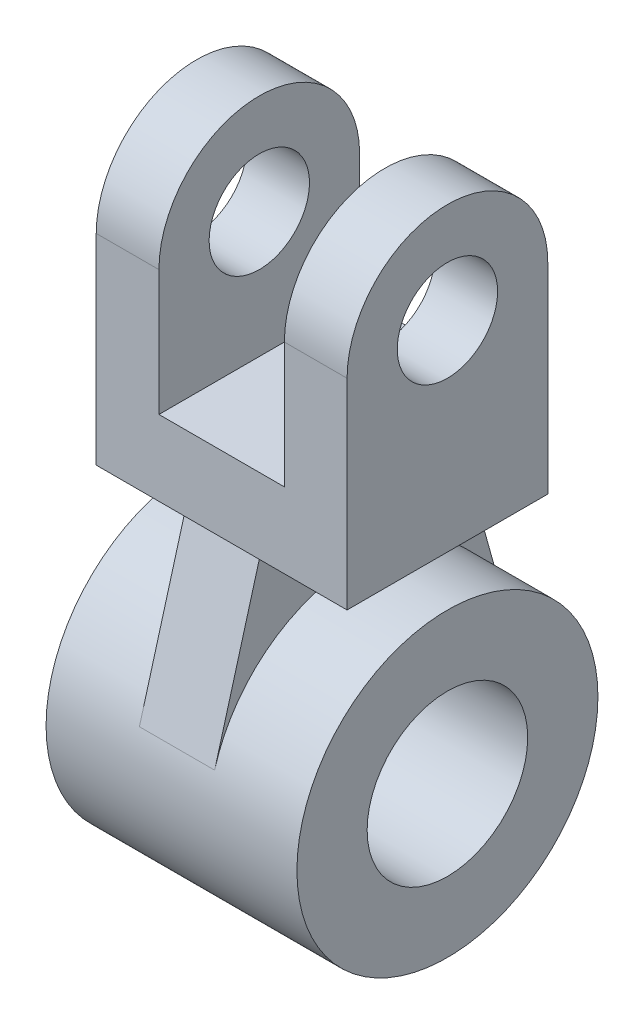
ISO-10303-21;
HEADER;
FILE_DESCRIPTION(('STEP AP214'),'2;1');
FILE_NAME('part.step','',(''),(''),'','','');
FILE_SCHEMA(('AUTOMOTIVE_DESIGN { 1 0 10303 214 1 1 1 1 }'));
ENDSEC;
DATA;
#1=APPLICATION_CONTEXT('core data for automotive mechanical design processes');
#2=APPLICATION_PROTOCOL_DEFINITION('international standard','automotive_design',2000,#1);
#3=PRODUCT_CONTEXT('',#1,'mechanical');
#4=PRODUCT('Part','Part','',(#3));
#5=PRODUCT_RELATED_PRODUCT_CATEGORY('part','',(#4));
#6=PRODUCT_DEFINITION_FORMATION('','',#4);
#7=PRODUCT_DEFINITION_CONTEXT('part definition',#1,'design');
#8=PRODUCT_DEFINITION('design','',#6,#7);
#9=PRODUCT_DEFINITION_SHAPE('','',#8);
#10=(LENGTH_UNIT() NAMED_UNIT(*) SI_UNIT(.MILLI.,.METRE.));
#11=(NAMED_UNIT(*) PLANE_ANGLE_UNIT() SI_UNIT($,.RADIAN.));
#12=(NAMED_UNIT(*) SI_UNIT($,.STERADIAN.) SOLID_ANGLE_UNIT());
#13=UNCERTAINTY_MEASURE_WITH_UNIT(LENGTH_MEASURE(1.E-05),#10,'distance_accuracy_value','');
#14=(GEOMETRIC_REPRESENTATION_CONTEXT(3) GLOBAL_UNCERTAINTY_ASSIGNED_CONTEXT((#13)) GLOBAL_UNIT_ASSIGNED_CONTEXT((#10,
#11,#12)) REPRESENTATION_CONTEXT('',''));
#15=CARTESIAN_POINT('',(0.,0.,0.));
#16=DIRECTION('',(0.,0.,1.));
#17=DIRECTION('',(1.,0.,0.));
#18=AXIS2_PLACEMENT_3D('',#15,#16,#17);
#19=CARTESIAN_POINT('',(-50.,0.,0.));
#20=DIRECTION('',(1.,0.,0.));
#21=DIRECTION('',(0.,0.,-1.));
#22=AXIS2_PLACEMENT_3D('',#19,#20,#21);
#23=CYLINDRICAL_SURFACE('',#22,30.);
#24=CARTESIAN_POINT('',(-32.5,0.,0.));
#25=DIRECTION('',(1.,0.,0.));
#26=DIRECTION('',(0.,0.,1.));
#27=AXIS2_PLACEMENT_3D('',#24,#25,#26);
#28=CIRCLE('',#27,30.);
#29=CARTESIAN_POINT('',(-32.5,8.05012538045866,-28.899748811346));
#30=VERTEX_POINT('',#29);
#31=CARTESIAN_POINT('',(-32.5,8.0501256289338,28.8997487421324));
#32=VERTEX_POINT('',#31);
#33=EDGE_CURVE('E64',#30,#32,#28,.T.);
#34=ORIENTED_EDGE('',*,*,#33,.F.);
#35=DIRECTION('',(1.,0.,0.));
#36=VECTOR('',#35,1.);
#37=CARTESIAN_POINT('',(-32.5,8.05012538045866,-28.899748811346));
#38=LINE('',#37,#36);
#39=CARTESIAN_POINT('',(-17.5,8.05012538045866,-28.899748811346));
#40=VERTEX_POINT('',#39);
#41=EDGE_CURVE('E276',#30,#40,#38,.T.);
#42=ORIENTED_EDGE('',*,*,#41,.T.);
#43=CARTESIAN_POINT('',(-17.5,0.,0.));
#44=DIRECTION('',(1.,0.,0.));
#45=DIRECTION('',(0.,0.,1.));
#46=AXIS2_PLACEMENT_3D('',#43,#44,#45);
#47=CIRCLE('',#46,30.);
#48=CARTESIAN_POINT('',(-17.5,8.0501256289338,28.8997487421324));
#49=VERTEX_POINT('',#48);
#50=EDGE_CURVE('E263',#40,#49,#47,.T.);
#51=ORIENTED_EDGE('',*,*,#50,.T.);
#52=DIRECTION('',(1.,0.,0.));
#53=VECTOR('',#52,1.);
#54=CARTESIAN_POINT('',(-32.5,8.0501256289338,28.8997487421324));
#55=LINE('',#54,#53);
#56=EDGE_CURVE('E256',#32,#49,#55,.T.);
#57=ORIENTED_EDGE('',*,*,#56,.F.);
#58=EDGE_LOOP('',(#34,#42,#51,#57));
#59=FACE_BOUND('',#58,.T.);
#60=CARTESIAN_POINT('',(-50.,0.,0.));
#61=DIRECTION('',(1.,0.,0.));
#62=DIRECTION('',(0.,0.,-1.));
#63=AXIS2_PLACEMENT_3D('',#60,#61,#62);
#64=CIRCLE('',#63,30.);
#65=CARTESIAN_POINT('',(-50.,0.,-30.));
#66=VERTEX_POINT('',#65);
#67=EDGE_CURVE('E11',#66,#66,#64,.T.);
#68=ORIENTED_EDGE('',*,*,#67,.T.);
#69=EDGE_LOOP('',(#68));
#70=FACE_BOUND('',#69,.T.);
#71=CARTESIAN_POINT('',(0.,0.,0.));
#72=DIRECTION('',(1.,0.,0.));
#73=DIRECTION('',(0.,0.,-1.));
#74=AXIS2_PLACEMENT_3D('',#71,#72,#73);
#75=CIRCLE('',#74,30.);
#76=CARTESIAN_POINT('',(0.,0.,-30.));
#77=VERTEX_POINT('',#76);
#78=EDGE_CURVE('E47',#77,#77,#75,.T.);
#79=ORIENTED_EDGE('',*,*,#78,.F.);
#80=EDGE_LOOP('',(#79));
#81=FACE_BOUND('',#80,.T.);
#82=ADVANCED_FACE('F39',(#59,#70,#81),#23,.T.);
#83=CARTESIAN_POINT('',(-50.,0.,0.));
#84=DIRECTION('',(1.,0.,0.));
#85=DIRECTION('',(0.,0.,-1.));
#86=AXIS2_PLACEMENT_3D('',#83,#84,#85);
#87=PLANE('',#86);
#88=CARTESIAN_POINT('',(-50.,0.,0.));
#89=DIRECTION('',(1.,0.,0.));
#90=DIRECTION('',(0.,0.,-1.));
#91=AXIS2_PLACEMENT_3D('',#88,#89,#90);
#92=CIRCLE('',#91,16.);
#93=CARTESIAN_POINT('',(-50.,0.,-16.));
#94=VERTEX_POINT('',#93);
#95=EDGE_CURVE('E280',#94,#94,#92,.T.);
#96=ORIENTED_EDGE('',*,*,#95,.T.);
#97=EDGE_LOOP('',(#96));
#98=FACE_BOUND('',#97,.T.);
#99=ORIENTED_EDGE('',*,*,#67,.F.);
#100=EDGE_LOOP('',(#99));
#101=FACE_BOUND('',#100,.T.);
#102=ADVANCED_FACE('F340',(#98,#101),#87,.F.);
#103=CARTESIAN_POINT('',(0.,0.,0.));
#104=DIRECTION('',(1.,0.,0.));
#105=DIRECTION('',(0.,0.,-1.));
#106=AXIS2_PLACEMENT_3D('',#103,#104,#105);
#107=PLANE('',#106);
#108=CARTESIAN_POINT('',(0.,0.,0.));
#109=DIRECTION('',(1.,0.,0.));
#110=DIRECTION('',(0.,0.,-1.));
#111=AXIS2_PLACEMENT_3D('',#108,#109,#110);
#112=CIRCLE('',#111,16.);
#113=CARTESIAN_POINT('',(0.,0.,-16.));
#114=VERTEX_POINT('',#113);
#115=EDGE_CURVE('E283',#114,#114,#112,.T.);
#116=ORIENTED_EDGE('',*,*,#115,.F.);
#117=EDGE_LOOP('',(#116));
#118=FACE_BOUND('',#117,.T.);
#119=ORIENTED_EDGE('',*,*,#78,.T.);
#120=EDGE_LOOP('',(#119));
#121=FACE_BOUND('',#120,.T.);
#122=ADVANCED_FACE('F344',(#118,#121),#107,.T.);
#123=CARTESIAN_POINT('',(-50.,0.,0.));
#124=DIRECTION('',(1.,0.,0.));
#125=DIRECTION('',(0.,0.,-1.));
#126=AXIS2_PLACEMENT_3D('',#123,#124,#125);
#127=CYLINDRICAL_SURFACE('',#126,16.);
#128=ORIENTED_EDGE('',*,*,#95,.F.);
#129=EDGE_LOOP('',(#128));
#130=FACE_BOUND('',#129,.T.);
#131=ORIENTED_EDGE('',*,*,#115,.T.);
#132=EDGE_LOOP('',(#131));
#133=FACE_BOUND('',#132,.T.);
#134=ADVANCED_FACE('F350',(#130,#133),#127,.F.);
#135=CARTESIAN_POINT('',(-32.5,40.,-20.));
#136=DIRECTION('',(0.,-0.26833752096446,0.96332495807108));
#137=DIRECTION('',(0.,-0.96332495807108,-0.26833752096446));
#138=AXIS2_PLACEMENT_3D('',#135,#136,#137);
#139=PLANE('',#138);
#140=DIRECTION('',(0.,-0.96332495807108,-0.26833752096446));
#141=VECTOR('',#140,1.);
#142=CARTESIAN_POINT('',(-17.5,40.,-20.));
#143=LINE('',#142,#141);
#144=CARTESIAN_POINT('',(-17.5,40.,-20.));
#145=VERTEX_POINT('',#144);
#146=EDGE_CURVE('E76',#145,#40,#143,.T.);
#147=ORIENTED_EDGE('',*,*,#146,.T.);
#148=ORIENTED_EDGE('',*,*,#41,.F.);
#149=DIRECTION('',(0.,-0.96332495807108,-0.26833752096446));
#150=VECTOR('',#149,1.);
#151=CARTESIAN_POINT('',(-32.5,40.,-20.));
#152=LINE('',#151,#150);
#153=CARTESIAN_POINT('',(-32.5,40.,-20.));
#154=VERTEX_POINT('',#153);
#155=EDGE_CURVE('E288',#154,#30,#152,.T.);
#156=ORIENTED_EDGE('',*,*,#155,.F.);
#157=DIRECTION('',(1.,0.,0.));
#158=VECTOR('',#157,1.);
#159=CARTESIAN_POINT('',(-32.5,40.,-20.));
#160=LINE('',#159,#158);
#161=EDGE_CURVE('E279',#154,#145,#160,.T.);
#162=ORIENTED_EDGE('',*,*,#161,.T.);
#163=EDGE_LOOP('',(#147,#148,#156,#162));
#164=FACE_BOUND('',#163,.T.);
#165=ADVANCED_FACE('F306',(#164),#139,.F.);
#166=CARTESIAN_POINT('',(-32.5,40.,20.));
#167=DIRECTION('',(0.,-0.26833752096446,-0.96332495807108));
#168=DIRECTION('',(0.,0.96332495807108,-0.26833752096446));
#169=AXIS2_PLACEMENT_3D('',#166,#167,#168);
#170=PLANE('',#169);
#171=DIRECTION('',(0.,0.96332495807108,-0.26833752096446));
#172=VECTOR('',#171,1.);
#173=CARTESIAN_POINT('',(-17.5,40.,20.));
#174=LINE('',#173,#172);
#175=CARTESIAN_POINT('',(-17.5,40.,20.));
#176=VERTEX_POINT('',#175);
#177=EDGE_CURVE('E55',#49,#176,#174,.T.);
#178=ORIENTED_EDGE('',*,*,#177,.T.);
#179=DIRECTION('',(1.,0.,0.));
#180=VECTOR('',#179,1.);
#181=CARTESIAN_POINT('',(-32.5,40.,20.));
#182=LINE('',#181,#180);
#183=CARTESIAN_POINT('',(-32.5,40.,20.));
#184=VERTEX_POINT('',#183);
#185=EDGE_CURVE('E253',#184,#176,#182,.T.);
#186=ORIENTED_EDGE('',*,*,#185,.F.);
#187=DIRECTION('',(0.,0.96332495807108,-0.26833752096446));
#188=VECTOR('',#187,1.);
#189=CARTESIAN_POINT('',(-32.5,40.,20.));
#190=LINE('',#189,#188);
#191=EDGE_CURVE('E257',#32,#184,#190,.T.);
#192=ORIENTED_EDGE('',*,*,#191,.F.);
#193=ORIENTED_EDGE('',*,*,#56,.T.);
#194=EDGE_LOOP('',(#178,#186,#192,#193));
#195=FACE_BOUND('',#194,.T.);
#196=ADVANCED_FACE('F259',(#195),#170,.F.);
#197=CARTESIAN_POINT('',(-32.5,0.,0.));
#198=DIRECTION('',(-1.,0.,0.));
#199=DIRECTION('',(0.,0.,1.));
#200=AXIS2_PLACEMENT_3D('',#197,#198,#199);
#201=PLANE('',#200);
#202=DIRECTION('',(0.,0.,-1.));
#203=VECTOR('',#202,1.);
#204=CARTESIAN_POINT('',(-32.5,40.,-20.));
#205=LINE('',#204,#203);
#206=EDGE_CURVE('E262',#184,#154,#205,.T.);
#207=ORIENTED_EDGE('',*,*,#206,.T.);
#208=ORIENTED_EDGE('',*,*,#155,.T.);
#209=ORIENTED_EDGE('',*,*,#33,.T.);
#210=ORIENTED_EDGE('',*,*,#191,.T.);
#211=EDGE_LOOP('',(#207,#208,#209,#210));
#212=FACE_BOUND('',#211,.T.);
#213=ADVANCED_FACE('F302',(#212),#201,.T.);
#214=CARTESIAN_POINT('',(-17.5,0.,0.));
#215=DIRECTION('',(-1.,0.,0.));
#216=DIRECTION('',(0.,0.,1.));
#217=AXIS2_PLACEMENT_3D('',#214,#215,#216);
#218=PLANE('',#217);
#219=DIRECTION('',(0.,0.,-1.));
#220=VECTOR('',#219,1.);
#221=CARTESIAN_POINT('',(-17.5,40.,-20.));
#222=LINE('',#221,#220);
#223=EDGE_CURVE('E84',#176,#145,#222,.T.);
#224=ORIENTED_EDGE('',*,*,#223,.F.);
#225=ORIENTED_EDGE('',*,*,#177,.F.);
#226=ORIENTED_EDGE('',*,*,#50,.F.);
#227=ORIENTED_EDGE('',*,*,#146,.F.);
#228=EDGE_LOOP('',(#224,#225,#226,#227));
#229=FACE_BOUND('',#228,.T.);
#230=ADVANCED_FACE('F265',(#229),#218,.F.);
#231=CARTESIAN_POINT('',(-12.5,40.,0.));
#232=DIRECTION('',(0.,-1.,0.));
#233=DIRECTION('',(0.,0.,-1.));
#234=AXIS2_PLACEMENT_3D('',#231,#232,#233);
#235=PLANE('',#234);
#236=ORIENTED_EDGE('',*,*,#206,.F.);
#237=DIRECTION('',(1.,0.,0.));
#238=VECTOR('',#237,1.);
#239=CARTESIAN_POINT('',(-12.5,40.,20.));
#240=LINE('',#239,#238);
#241=CARTESIAN_POINT('',(-50.,40.,20.));
#242=VERTEX_POINT('',#241);
#243=EDGE_CURVE('E192',#242,#184,#240,.T.);
#244=ORIENTED_EDGE('',*,*,#243,.F.);
#245=DIRECTION('',(0.,0.,1.));
#246=VECTOR('',#245,1.);
#247=CARTESIAN_POINT('',(-50.,40.,-20.));
#248=LINE('',#247,#246);
#249=CARTESIAN_POINT('',(-50.,40.,-20.));
#250=VERTEX_POINT('',#249);
#251=EDGE_CURVE('E169',#250,#242,#248,.T.);
#252=ORIENTED_EDGE('',*,*,#251,.F.);
#253=DIRECTION('',(1.,0.,0.));
#254=VECTOR('',#253,1.);
#255=CARTESIAN_POINT('',(-12.5,40.,-20.));
#256=LINE('',#255,#254);
#257=EDGE_CURVE('E242',#250,#154,#256,.T.);
#258=ORIENTED_EDGE('',*,*,#257,.T.);
#259=EDGE_LOOP('',(#236,#244,#252,#258));
#260=FACE_BOUND('',#259,.T.);
#261=ADVANCED_FACE('F310',(#260),#235,.T.);
#262=CARTESIAN_POINT('',(-12.5,0.,-20.));
#263=DIRECTION('',(0.,0.,1.));
#264=DIRECTION('',(1.,0.,0.));
#265=AXIS2_PLACEMENT_3D('',#262,#263,#264);
#266=PLANE('',#265);
#267=DIRECTION('',(0.,-1.,0.));
#268=VECTOR('',#267,1.);
#269=CARTESIAN_POINT('',(0.,0.,-20.));
#270=LINE('',#269,#268);
#271=CARTESIAN_POINT('',(0.,80.,-20.));
#272=VERTEX_POINT('',#271);
#273=CARTESIAN_POINT('',(0.,40.,-20.));
#274=VERTEX_POINT('',#273);
#275=EDGE_CURVE('E224',#272,#274,#270,.T.);
#276=ORIENTED_EDGE('',*,*,#275,.T.);
#277=EDGE_CURVE('E196',#145,#274,#256,.T.);
#278=ORIENTED_EDGE('',*,*,#277,.F.);
#279=ORIENTED_EDGE('',*,*,#161,.F.);
#280=ORIENTED_EDGE('',*,*,#257,.F.);
#281=DIRECTION('',(0.,-1.,0.));
#282=VECTOR('',#281,1.);
#283=CARTESIAN_POINT('',(-50.,80.,-20.));
#284=LINE('',#283,#282);
#285=CARTESIAN_POINT('',(-50.,80.,-20.));
#286=VERTEX_POINT('',#285);
#287=EDGE_CURVE('E148',#286,#250,#284,.T.);
#288=ORIENTED_EDGE('',*,*,#287,.F.);
#289=DIRECTION('',(-1.,0.,0.));
#290=VECTOR('',#289,1.);
#291=CARTESIAN_POINT('',(-37.5,80.,-20.));
#292=LINE('',#291,#290);
#293=CARTESIAN_POINT('',(-37.5,80.,-20.));
#294=VERTEX_POINT('',#293);
#295=EDGE_CURVE('E140',#294,#286,#292,.T.);
#296=ORIENTED_EDGE('',*,*,#295,.F.);
#297=DIRECTION('',(0.,-1.,0.));
#298=VECTOR('',#297,1.);
#299=CARTESIAN_POINT('',(-37.5,80.,-20.));
#300=LINE('',#299,#298);
#301=CARTESIAN_POINT('',(-37.5,55.,-20.));
#302=VERTEX_POINT('',#301);
#303=EDGE_CURVE('E145',#294,#302,#300,.T.);
#304=ORIENTED_EDGE('',*,*,#303,.T.);
#305=DIRECTION('',(-1.,0.,0.));
#306=VECTOR('',#305,1.);
#307=CARTESIAN_POINT('',(-37.5,55.,-20.));
#308=LINE('',#307,#306);
#309=CARTESIAN_POINT('',(-12.5,55.,-20.));
#310=VERTEX_POINT('',#309);
#311=EDGE_CURVE('E320',#310,#302,#308,.T.);
#312=ORIENTED_EDGE('',*,*,#311,.F.);
#313=DIRECTION('',(0.,-1.,0.));
#314=VECTOR('',#313,1.);
#315=CARTESIAN_POINT('',(-12.5,0.,-20.));
#316=LINE('',#315,#314);
#317=CARTESIAN_POINT('',(-12.5,80.,-20.));
#318=VERTEX_POINT('',#317);
#319=EDGE_CURVE('E210',#318,#310,#316,.T.);
#320=ORIENTED_EDGE('',*,*,#319,.F.);
#321=DIRECTION('',(1.,0.,0.));
#322=VECTOR('',#321,1.);
#323=CARTESIAN_POINT('',(-12.5,80.,-20.));
#324=LINE('',#323,#322);
#325=EDGE_CURVE('E207',#318,#272,#324,.T.);
#326=ORIENTED_EDGE('',*,*,#325,.T.);
#327=EDGE_LOOP('',(#276,#278,#279,#280,#288,#296,#304,#312,#320,#326));
#328=FACE_BOUND('',#327,.T.);
#329=ADVANCED_FACE('F143',(#328),#266,.F.);
#330=CARTESIAN_POINT('',(0.,40.,20.));
#331=VERTEX_POINT('',#330);
#332=EDGE_CURVE('E197',#176,#331,#240,.T.);
#333=ORIENTED_EDGE('',*,*,#332,.F.);
#334=ORIENTED_EDGE('',*,*,#223,.T.);
#335=ORIENTED_EDGE('',*,*,#277,.T.);
#336=DIRECTION('',(0.,0.,-1.));
#337=VECTOR('',#336,1.);
#338=CARTESIAN_POINT('',(0.,40.,0.));
#339=LINE('',#338,#337);
#340=EDGE_CURVE('E215',#331,#274,#339,.T.);
#341=ORIENTED_EDGE('',*,*,#340,.F.);
#342=EDGE_LOOP('',(#333,#334,#335,#341));
#343=FACE_BOUND('',#342,.T.);
#344=ADVANCED_FACE('F239',(#343),#235,.T.);
#345=CARTESIAN_POINT('',(-12.5,0.,20.));
#346=DIRECTION('',(0.,0.,1.));
#347=DIRECTION('',(1.,0.,0.));
#348=AXIS2_PLACEMENT_3D('',#345,#346,#347);
#349=PLANE('',#348);
#350=DIRECTION('',(0.,-1.,0.));
#351=VECTOR('',#350,1.);
#352=CARTESIAN_POINT('',(0.,0.,20.));
#353=LINE('',#352,#351);
#354=CARTESIAN_POINT('',(0.,80.,20.));
#355=VERTEX_POINT('',#354);
#356=EDGE_CURVE('E230',#355,#331,#353,.T.);
#357=ORIENTED_EDGE('',*,*,#356,.F.);
#358=DIRECTION('',(1.,0.,0.));
#359=VECTOR('',#358,1.);
#360=CARTESIAN_POINT('',(-12.5,80.,20.));
#361=LINE('',#360,#359);
#362=CARTESIAN_POINT('',(-12.5,80.,20.));
#363=VERTEX_POINT('',#362);
#364=EDGE_CURVE('E204',#363,#355,#361,.T.);
#365=ORIENTED_EDGE('',*,*,#364,.F.);
#366=DIRECTION('',(0.,-1.,0.));
#367=VECTOR('',#366,1.);
#368=CARTESIAN_POINT('',(-12.5,0.,20.));
#369=LINE('',#368,#367);
#370=CARTESIAN_POINT('',(-12.5,55.,20.));
#371=VERTEX_POINT('',#370);
#372=EDGE_CURVE('E209',#363,#371,#369,.T.);
#373=ORIENTED_EDGE('',*,*,#372,.T.);
#374=DIRECTION('',(-1.,0.,0.));
#375=VECTOR('',#374,1.);
#376=CARTESIAN_POINT('',(-37.5,55.,20.));
#377=LINE('',#376,#375);
#378=CARTESIAN_POINT('',(-37.5,55.,20.));
#379=VERTEX_POINT('',#378);
#380=EDGE_CURVE('E318',#371,#379,#377,.T.);
#381=ORIENTED_EDGE('',*,*,#380,.T.);
#382=DIRECTION('',(0.,1.,0.));
#383=VECTOR('',#382,1.);
#384=CARTESIAN_POINT('',(-37.5,40.,20.));
#385=LINE('',#384,#383);
#386=CARTESIAN_POINT('',(-37.5,80.,20.));
#387=VERTEX_POINT('',#386);
#388=EDGE_CURVE('E154',#379,#387,#385,.T.);
#389=ORIENTED_EDGE('',*,*,#388,.T.);
#390=DIRECTION('',(-1.,0.,0.));
#391=VECTOR('',#390,1.);
#392=CARTESIAN_POINT('',(-37.5,80.,20.));
#393=LINE('',#392,#391);
#394=CARTESIAN_POINT('',(-50.,80.,20.));
#395=VERTEX_POINT('',#394);
#396=EDGE_CURVE('E153',#387,#395,#393,.T.);
#397=ORIENTED_EDGE('',*,*,#396,.T.);
#398=DIRECTION('',(0.,1.,0.));
#399=VECTOR('',#398,1.);
#400=CARTESIAN_POINT('',(-50.,40.,20.));
#401=LINE('',#400,#399);
#402=EDGE_CURVE('E166',#242,#395,#401,.T.);
#403=ORIENTED_EDGE('',*,*,#402,.F.);
#404=ORIENTED_EDGE('',*,*,#243,.T.);
#405=ORIENTED_EDGE('',*,*,#185,.T.);
#406=ORIENTED_EDGE('',*,*,#332,.T.);
#407=EDGE_LOOP('',(#357,#365,#373,#381,#389,#397,#403,#404,#405,#406));
#408=FACE_BOUND('',#407,.T.);
#409=ADVANCED_FACE('F251',(#408),#349,.T.);
#410=CARTESIAN_POINT('',(-12.5,80.,0.));
#411=DIRECTION('',(1.,0.,0.));
#412=DIRECTION('',(0.,0.,-1.));
#413=AXIS2_PLACEMENT_3D('',#410,#411,#412);
#414=CYLINDRICAL_SURFACE('',#413,20.);
#415=CARTESIAN_POINT('',(0.,80.,0.));
#416=DIRECTION('',(1.,0.,0.));
#417=DIRECTION('',(0.,0.,-1.));
#418=AXIS2_PLACEMENT_3D('',#415,#416,#417);
#419=CIRCLE('',#418,20.);
#420=EDGE_CURVE('E226',#272,#355,#419,.T.);
#421=ORIENTED_EDGE('',*,*,#420,.F.);
#422=ORIENTED_EDGE('',*,*,#325,.F.);
#423=CARTESIAN_POINT('',(-12.5,80.,0.));
#424=DIRECTION('',(1.,0.,0.));
#425=DIRECTION('',(0.,0.,-1.));
#426=AXIS2_PLACEMENT_3D('',#423,#424,#425);
#427=CIRCLE('',#426,20.);
#428=EDGE_CURVE('E214',#318,#363,#427,.T.);
#429=ORIENTED_EDGE('',*,*,#428,.T.);
#430=ORIENTED_EDGE('',*,*,#364,.T.);
#431=EDGE_LOOP('',(#421,#422,#429,#430));
#432=FACE_BOUND('',#431,.T.);
#433=ADVANCED_FACE('F247',(#432),#414,.T.);
#434=CARTESIAN_POINT('',(-12.5,0.,0.));
#435=DIRECTION('',(1.,0.,0.));
#436=DIRECTION('',(0.,0.,-1.));
#437=AXIS2_PLACEMENT_3D('',#434,#435,#436);
#438=PLANE('',#437);
#439=CARTESIAN_POINT('',(-12.5,80.,0.));
#440=DIRECTION('',(1.,0.,0.));
#441=DIRECTION('',(0.,0.,-1.));
#442=AXIS2_PLACEMENT_3D('',#439,#440,#441);
#443=CIRCLE('',#442,10.);
#444=CARTESIAN_POINT('',(-12.5,80.,-10.));
#445=VERTEX_POINT('',#444);
#446=EDGE_CURVE('E227',#445,#445,#443,.T.);
#447=ORIENTED_EDGE('',*,*,#446,.T.);
#448=EDGE_LOOP('',(#447));
#449=FACE_BOUND('',#448,.T.);
#450=ORIENTED_EDGE('',*,*,#319,.T.);
#451=DIRECTION('',(0.,0.,1.));
#452=VECTOR('',#451,1.);
#453=CARTESIAN_POINT('',(-12.5,55.,-20.));
#454=LINE('',#453,#452);
#455=EDGE_CURVE('E189',#310,#371,#454,.T.);
#456=ORIENTED_EDGE('',*,*,#455,.T.);
#457=ORIENTED_EDGE('',*,*,#372,.F.);
#458=ORIENTED_EDGE('',*,*,#428,.F.);
#459=EDGE_LOOP('',(#450,#456,#457,#458));
#460=FACE_BOUND('',#459,.T.);
#461=ADVANCED_FACE('F326',(#449,#460),#438,.F.);
#462=CARTESIAN_POINT('',(0.,0.,0.));
#463=DIRECTION('',(1.,0.,0.));
#464=DIRECTION('',(0.,0.,-1.));
#465=AXIS2_PLACEMENT_3D('',#462,#463,#464);
#466=PLANE('',#465);
#467=CARTESIAN_POINT('',(0.,80.,0.));
#468=DIRECTION('',(1.,0.,0.));
#469=DIRECTION('',(0.,0.,-1.));
#470=AXIS2_PLACEMENT_3D('',#467,#468,#469);
#471=CIRCLE('',#470,10.);
#472=CARTESIAN_POINT('',(0.,80.,-10.));
#473=VERTEX_POINT('',#472);
#474=EDGE_CURVE('E188',#473,#473,#471,.T.);
#475=ORIENTED_EDGE('',*,*,#474,.F.);
#476=EDGE_LOOP('',(#475));
#477=FACE_BOUND('',#476,.T.);
#478=ORIENTED_EDGE('',*,*,#275,.F.);
#479=ORIENTED_EDGE('',*,*,#420,.T.);
#480=ORIENTED_EDGE('',*,*,#356,.T.);
#481=ORIENTED_EDGE('',*,*,#340,.T.);
#482=EDGE_LOOP('',(#478,#479,#480,#481));
#483=FACE_BOUND('',#482,.T.);
#484=ADVANCED_FACE('F236',(#477,#483),#466,.T.);
#485=CARTESIAN_POINT('',(-12.5,80.,0.));
#486=DIRECTION('',(1.,0.,0.));
#487=DIRECTION('',(0.,0.,-1.));
#488=AXIS2_PLACEMENT_3D('',#485,#486,#487);
#489=CYLINDRICAL_SURFACE('',#488,10.);
#490=ORIENTED_EDGE('',*,*,#446,.F.);
#491=EDGE_LOOP('',(#490));
#492=FACE_BOUND('',#491,.T.);
#493=ORIENTED_EDGE('',*,*,#474,.T.);
#494=EDGE_LOOP('',(#493));
#495=FACE_BOUND('',#494,.T.);
#496=ADVANCED_FACE('F330',(#492,#495),#489,.F.);
#497=CARTESIAN_POINT('',(-37.5,55.,-20.));
#498=DIRECTION('',(0.,1.,0.));
#499=DIRECTION('',(0.,0.,1.));
#500=AXIS2_PLACEMENT_3D('',#497,#498,#499);
#501=PLANE('',#500);
#502=ORIENTED_EDGE('',*,*,#380,.F.);
#503=ORIENTED_EDGE('',*,*,#455,.F.);
#504=ORIENTED_EDGE('',*,*,#311,.T.);
#505=DIRECTION('',(0.,0.,1.));
#506=VECTOR('',#505,1.);
#507=CARTESIAN_POINT('',(-37.5,55.,-20.));
#508=LINE('',#507,#506);
#509=EDGE_CURVE('E162',#302,#379,#508,.T.);
#510=ORIENTED_EDGE('',*,*,#509,.T.);
#511=EDGE_LOOP('',(#502,#503,#504,#510));
#512=FACE_BOUND('',#511,.T.);
#513=ADVANCED_FACE('F328',(#512),#501,.T.);
#514=CARTESIAN_POINT('',(-37.5,80.,0.));
#515=DIRECTION('',(-1.,0.,0.));
#516=DIRECTION('',(0.,0.,1.));
#517=AXIS2_PLACEMENT_3D('',#514,#515,#516);
#518=CYLINDRICAL_SURFACE('',#517,20.);
#519=CARTESIAN_POINT('',(-50.,80.,0.));
#520=DIRECTION('',(-1.,0.,0.));
#521=DIRECTION('',(0.,0.,1.));
#522=AXIS2_PLACEMENT_3D('',#519,#520,#521);
#523=CIRCLE('',#522,20.);
#524=EDGE_CURVE('E314',#395,#286,#523,.T.);
#525=ORIENTED_EDGE('',*,*,#524,.F.);
#526=ORIENTED_EDGE('',*,*,#396,.F.);
#527=CARTESIAN_POINT('',(-37.5,80.,0.));
#528=DIRECTION('',(-1.,0.,0.));
#529=DIRECTION('',(0.,0.,1.));
#530=AXIS2_PLACEMENT_3D('',#527,#528,#529);
#531=CIRCLE('',#530,20.);
#532=EDGE_CURVE('E160',#387,#294,#531,.T.);
#533=ORIENTED_EDGE('',*,*,#532,.T.);
#534=ORIENTED_EDGE('',*,*,#295,.T.);
#535=EDGE_LOOP('',(#525,#526,#533,#534));
#536=FACE_BOUND('',#535,.T.);
#537=ADVANCED_FACE('F165',(#536),#518,.T.);
#538=CARTESIAN_POINT('',(-37.5,80.,0.));
#539=DIRECTION('',(-1.,0.,0.));
#540=DIRECTION('',(0.,0.,1.));
#541=AXIS2_PLACEMENT_3D('',#538,#539,#540);
#542=PLANE('',#541);
#543=ORIENTED_EDGE('',*,*,#509,.F.);
#544=ORIENTED_EDGE('',*,*,#303,.F.);
#545=ORIENTED_EDGE('',*,*,#532,.F.);
#546=ORIENTED_EDGE('',*,*,#388,.F.);
#547=EDGE_LOOP('',(#543,#544,#545,#546));
#548=FACE_BOUND('',#547,.T.);
#549=CARTESIAN_POINT('',(-37.5,80.,0.));
#550=DIRECTION('',(-1.,0.,0.));
#551=DIRECTION('',(0.,0.,1.));
#552=AXIS2_PLACEMENT_3D('',#549,#550,#551);
#553=CIRCLE('',#552,10.);
#554=CARTESIAN_POINT('',(-37.5,80.,10.));
#555=VERTEX_POINT('',#554);
#556=EDGE_CURVE('E316',#555,#555,#553,.T.);
#557=ORIENTED_EDGE('',*,*,#556,.T.);
#558=EDGE_LOOP('',(#557));
#559=FACE_BOUND('',#558,.T.);
#560=ADVANCED_FACE('F158',(#548,#559),#542,.F.);
#561=CARTESIAN_POINT('',(-50.,80.,0.));
#562=DIRECTION('',(-1.,0.,0.));
#563=DIRECTION('',(0.,0.,1.));
#564=AXIS2_PLACEMENT_3D('',#561,#562,#563);
#565=PLANE('',#564);
#566=CARTESIAN_POINT('',(-50.,80.,0.));
#567=DIRECTION('',(-1.,0.,0.));
#568=DIRECTION('',(0.,0.,1.));
#569=AXIS2_PLACEMENT_3D('',#566,#567,#568);
#570=CIRCLE('',#569,10.);
#571=CARTESIAN_POINT('',(-50.,80.,10.));
#572=VERTEX_POINT('',#571);
#573=EDGE_CURVE('E173',#572,#572,#570,.T.);
#574=ORIENTED_EDGE('',*,*,#573,.F.);
#575=EDGE_LOOP('',(#574));
#576=FACE_BOUND('',#575,.T.);
#577=ORIENTED_EDGE('',*,*,#524,.T.);
#578=ORIENTED_EDGE('',*,*,#287,.T.);
#579=ORIENTED_EDGE('',*,*,#251,.T.);
#580=ORIENTED_EDGE('',*,*,#402,.T.);
#581=EDGE_LOOP('',(#577,#578,#579,#580));
#582=FACE_BOUND('',#581,.T.);
#583=ADVANCED_FACE('F313',(#576,#582),#565,.T.);
#584=CARTESIAN_POINT('',(-37.5,80.,0.));
#585=DIRECTION('',(-1.,0.,0.));
#586=DIRECTION('',(0.,0.,1.));
#587=AXIS2_PLACEMENT_3D('',#584,#585,#586);
#588=CYLINDRICAL_SURFACE('',#587,10.);
#589=ORIENTED_EDGE('',*,*,#556,.F.);
#590=EDGE_LOOP('',(#589));
#591=FACE_BOUND('',#590,.T.);
#592=ORIENTED_EDGE('',*,*,#573,.T.);
#593=EDGE_LOOP('',(#592));
#594=FACE_BOUND('',#593,.T.);
#595=ADVANCED_FACE('F422',(#591,#594),#588,.F.);
#596=CLOSED_SHELL('',(#82,#102,#122,#134,#165,#196,#213,#230,#261,#329,#344,#409,#433,#461,#484,
#496,#513,#537,#560,#583,#595));
#597=MANIFOLD_SOLID_BREP('B2',#596);
#598=ADVANCED_BREP_SHAPE_REPRESENTATION('',(#18,#597),#14);
#599=SHAPE_DEFINITION_REPRESENTATION(#9,#598);
ENDSEC;
END-ISO-10303-21;
